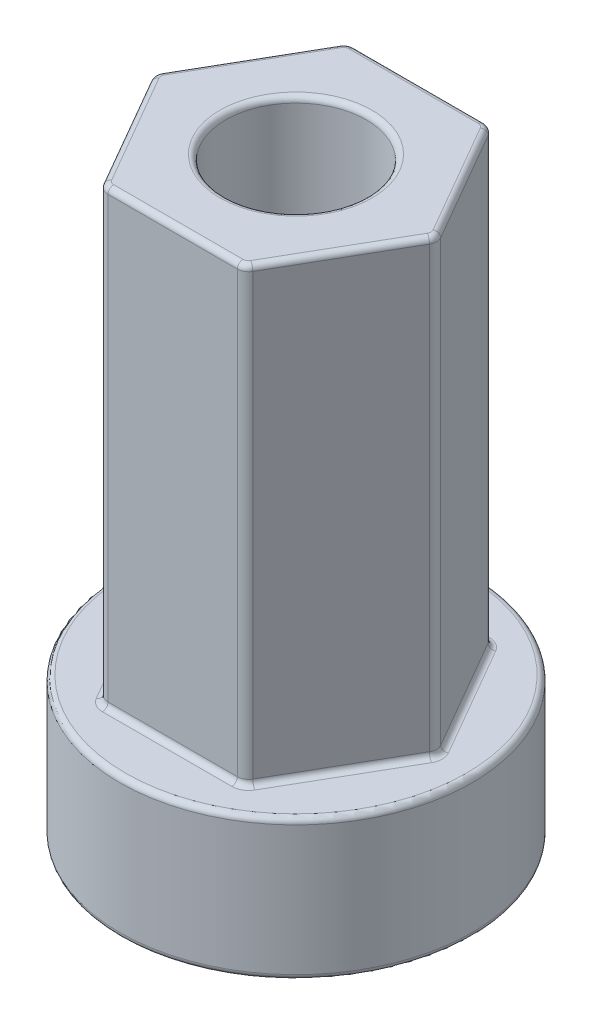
from build123d import *

# Parameters (mm, degrees)
SKETCH1_R          = 7.9375
EXTRUDE1_DEPTH     = 6.35
EXTRUDE2_DEPTH     = 20.32
SKETCH3_R          = 3.175
CUT_EXTRUDE1_DEPTH = 29.936079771
FILLET1_R          = 0.508
FILLET2_R          = 0.254


with BuildPart() as part:
    # Sketch1 → Extrude1 (new body)
    with BuildSketch(Plane(origin=(0, 0, 0), x_dir=(1, 0, 0), z_dir=(0, 1, 0))):
        with Locations(Location((0, 0, 0), (0, 0, 270))):
            Circle(SKETCH1_R)
    extrude(amount=EXTRUDE1_DEPTH)

    # Sketch2 → Extrude2 (add)
    with BuildSketch(Plane(origin=(0, 6.35, 0), x_dir=(-1, 0, 0), z_dir=(0, 1, 0))):
        Polygon((6.415804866, 0), (3.207902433, 5.55625), (-3.207902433, 5.55625), (-6.415804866, 0), (-3.207902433, -5.55625), (3.207902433, -5.55625), align=None)
    extrude(amount=EXTRUDE2_DEPTH)

    # Sketch3 → Cut-Extrude1 (cut, through all)
    with BuildSketch(Plane(origin=(0, 26.67, 0), x_dir=(-1, 0, 0), z_dir=(0, 1, 0))):
        with Locations(Location((0, 0, 0), (0, 0, 90))):
            Circle(SKETCH3_R)
    extrude(amount=-CUT_EXTRUDE1_DEPTH, mode=Mode.SUBTRACT)

    # Fillet1
    fillet1_edges = [part.edges().sort_by_distance(p)[0] for p in [
        (6.415804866, 16.51, 0),
        (3.207902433, 16.51, -5.55625),
        (-3.207902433, 16.51, -5.55625),
        (-6.415804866, 16.51, 0),
        (-3.207902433, 16.51, 5.55625),
        (3.207902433, 16.51, 5.55625),
    ]]
    fillet(fillet1_edges, radius=FILLET1_R)

    # Fillet2
    fillet2_edges = [part.edges().sort_by_distance(p)[0] for p in [
        (0, 0, -7.9375),
        (0, 0, -3.175),
        (0, 26.67, -3.175),
        (-4.81185365, 6.35, -2.778125),
        (-4.81185365, 26.67, -2.778125),
        (0, 6.35, -5.55625),
        (0, 26.67, -5.55625),
        (-4.81185365, 26.67, 2.778125),
        (0, 26.67, 5.55625),
        (4.81185365, 26.67, 2.778125),
        (4.81185365, 26.67, -2.778125),
        (-6.337216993, 26.67, 0),
        (-3.168608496, 26.67, 5.488190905),
        (3.168608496, 26.67, 5.488190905),
        (6.337216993, 26.67, 0),
        (3.168608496, 26.67, -5.488190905),
        (-3.168608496, 26.67, -5.488190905),
        (4.81185365, 6.35, -2.778125),
        (4.81185365, 6.35, 2.778125),
        (0, 6.35, -7.9375),
        (0, 6.35, 5.55625),
        (-4.81185365, 6.35, 2.778125),
        (-3.168608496, 6.35, -5.488190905),
        (3.168608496, 6.35, -5.488190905),
        (6.337216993, 6.35, 0),
        (3.168608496, 6.35, 5.488190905),
        (-3.168608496, 6.35, 5.488190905),
        (-6.337216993, 6.35, 0),
    ]]
    fillet(fillet2_edges, radius=FILLET2_R)


solid = part.part
